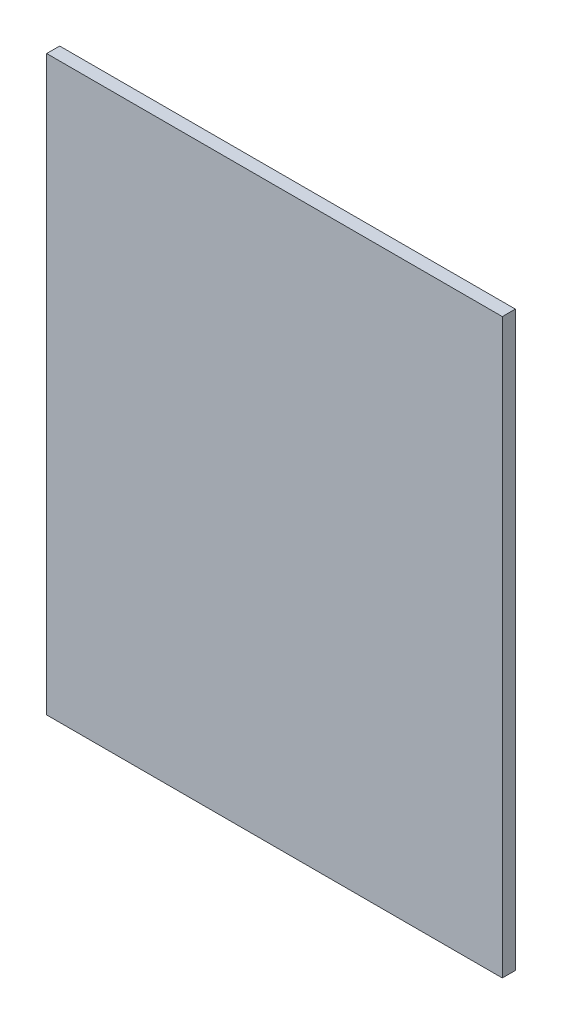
ISO-10303-21;
HEADER;
FILE_DESCRIPTION(('STEP AP214'),'2;1');
FILE_NAME('part.step','',(''),(''),'','','');
FILE_SCHEMA(('AUTOMOTIVE_DESIGN { 1 0 10303 214 1 1 1 1 }'));
ENDSEC;
DATA;
#1=APPLICATION_CONTEXT('core data for automotive mechanical design processes');
#2=APPLICATION_PROTOCOL_DEFINITION('international standard','automotive_design',2000,#1);
#3=PRODUCT_CONTEXT('',#1,'mechanical');
#4=PRODUCT('Part','Part','',(#3));
#5=PRODUCT_RELATED_PRODUCT_CATEGORY('part','',(#4));
#6=PRODUCT_DEFINITION_FORMATION('','',#4);
#7=PRODUCT_DEFINITION_CONTEXT('part definition',#1,'design');
#8=PRODUCT_DEFINITION('design','',#6,#7);
#9=PRODUCT_DEFINITION_SHAPE('','',#8);
#10=(LENGTH_UNIT() NAMED_UNIT(*) SI_UNIT(.MILLI.,.METRE.));
#11=(NAMED_UNIT(*) PLANE_ANGLE_UNIT() SI_UNIT($,.RADIAN.));
#12=(NAMED_UNIT(*) SI_UNIT($,.STERADIAN.) SOLID_ANGLE_UNIT());
#13=UNCERTAINTY_MEASURE_WITH_UNIT(LENGTH_MEASURE(1.E-05),#10,'distance_accuracy_value','');
#14=(GEOMETRIC_REPRESENTATION_CONTEXT(3) GLOBAL_UNCERTAINTY_ASSIGNED_CONTEXT((#13)) GLOBAL_UNIT_ASSIGNED_CONTEXT((#10,
#11,#12)) REPRESENTATION_CONTEXT('',''));
#15=CARTESIAN_POINT('',(0.,0.,0.));
#16=DIRECTION('',(0.,0.,1.));
#17=DIRECTION('',(1.,0.,0.));
#18=AXIS2_PLACEMENT_3D('',#15,#16,#17);
#19=CARTESIAN_POINT('',(175.,220.,5.));
#20=DIRECTION('',(-1.,0.,0.));
#21=DIRECTION('',(0.,-1.,0.));
#22=AXIS2_PLACEMENT_3D('',#19,#20,#21);
#23=PLANE('',#22);
#24=DIRECTION('',(0.,1.,0.));
#25=VECTOR('',#24,1.);
#26=CARTESIAN_POINT('',(175.,220.,-5.));
#27=LINE('',#26,#25);
#28=CARTESIAN_POINT('',(175.,-220.,-5.));
#29=VERTEX_POINT('',#28);
#30=CARTESIAN_POINT('',(175.,220.,-5.));
#31=VERTEX_POINT('',#30);
#32=EDGE_CURVE('E96',#29,#31,#27,.T.);
#33=ORIENTED_EDGE('',*,*,#32,.T.);
#34=DIRECTION('',(0.,0.,-1.));
#35=VECTOR('',#34,1.);
#36=CARTESIAN_POINT('',(175.,220.,5.));
#37=LINE('',#36,#35);
#38=CARTESIAN_POINT('',(175.,220.,5.));
#39=VERTEX_POINT('',#38);
#40=EDGE_CURVE('E11',#39,#31,#37,.T.);
#41=ORIENTED_EDGE('',*,*,#40,.F.);
#42=DIRECTION('',(0.,1.,0.));
#43=VECTOR('',#42,1.);
#44=CARTESIAN_POINT('',(175.,220.,5.));
#45=LINE('',#44,#43);
#46=CARTESIAN_POINT('',(175.,-220.,5.));
#47=VERTEX_POINT('',#46);
#48=EDGE_CURVE('E84',#47,#39,#45,.T.);
#49=ORIENTED_EDGE('',*,*,#48,.F.);
#50=DIRECTION('',(0.,0.,-1.));
#51=VECTOR('',#50,1.);
#52=CARTESIAN_POINT('',(175.,-220.,5.));
#53=LINE('',#52,#51);
#54=EDGE_CURVE('E92',#47,#29,#53,.T.);
#55=ORIENTED_EDGE('',*,*,#54,.T.);
#56=EDGE_LOOP('',(#33,#41,#49,#55));
#57=FACE_BOUND('',#56,.T.);
#58=ADVANCED_FACE('F33',(#57),#23,.F.);
#59=CARTESIAN_POINT('',(-175.,220.,5.));
#60=DIRECTION('',(0.,-1.,0.));
#61=DIRECTION('',(0.,0.,-1.));
#62=AXIS2_PLACEMENT_3D('',#59,#60,#61);
#63=PLANE('',#62);
#64=DIRECTION('',(-1.,0.,0.));
#65=VECTOR('',#64,1.);
#66=CARTESIAN_POINT('',(-175.,220.,-5.));
#67=LINE('',#66,#65);
#68=CARTESIAN_POINT('',(-175.,220.,-5.));
#69=VERTEX_POINT('',#68);
#70=EDGE_CURVE('E88',#31,#69,#67,.T.);
#71=ORIENTED_EDGE('',*,*,#70,.T.);
#72=DIRECTION('',(0.,0.,-1.));
#73=VECTOR('',#72,1.);
#74=CARTESIAN_POINT('',(-175.,220.,5.));
#75=LINE('',#74,#73);
#76=CARTESIAN_POINT('',(-175.,220.,5.));
#77=VERTEX_POINT('',#76);
#78=EDGE_CURVE('E41',#77,#69,#75,.T.);
#79=ORIENTED_EDGE('',*,*,#78,.F.);
#80=DIRECTION('',(-1.,0.,0.));
#81=VECTOR('',#80,1.);
#82=CARTESIAN_POINT('',(-175.,220.,5.));
#83=LINE('',#82,#81);
#84=EDGE_CURVE('E79',#39,#77,#83,.T.);
#85=ORIENTED_EDGE('',*,*,#84,.F.);
#86=ORIENTED_EDGE('',*,*,#40,.T.);
#87=EDGE_LOOP('',(#71,#79,#85,#86));
#88=FACE_BOUND('',#87,.T.);
#89=ADVANCED_FACE('F87',(#88),#63,.F.);
#90=CARTESIAN_POINT('',(-175.,220.,5.));
#91=DIRECTION('',(1.,0.,0.));
#92=DIRECTION('',(0.,1.,0.));
#93=AXIS2_PLACEMENT_3D('',#90,#91,#92);
#94=PLANE('',#93);
#95=DIRECTION('',(0.,-1.,0.));
#96=VECTOR('',#95,1.);
#97=CARTESIAN_POINT('',(-175.,220.,-5.));
#98=LINE('',#97,#96);
#99=CARTESIAN_POINT('',(-175.,-220.,-5.));
#100=VERTEX_POINT('',#99);
#101=EDGE_CURVE('E66',#69,#100,#98,.T.);
#102=ORIENTED_EDGE('',*,*,#101,.T.);
#103=DIRECTION('',(0.,0.,-1.));
#104=VECTOR('',#103,1.);
#105=CARTESIAN_POINT('',(-175.,-220.,5.));
#106=LINE('',#105,#104);
#107=CARTESIAN_POINT('',(-175.,-220.,5.));
#108=VERTEX_POINT('',#107);
#109=EDGE_CURVE('E89',#108,#100,#106,.T.);
#110=ORIENTED_EDGE('',*,*,#109,.F.);
#111=DIRECTION('',(0.,-1.,0.));
#112=VECTOR('',#111,1.);
#113=CARTESIAN_POINT('',(-175.,220.,5.));
#114=LINE('',#113,#112);
#115=EDGE_CURVE('E82',#77,#108,#114,.T.);
#116=ORIENTED_EDGE('',*,*,#115,.F.);
#117=ORIENTED_EDGE('',*,*,#78,.T.);
#118=EDGE_LOOP('',(#102,#110,#116,#117));
#119=FACE_BOUND('',#118,.T.);
#120=ADVANCED_FACE('F90',(#119),#94,.F.);
#121=CARTESIAN_POINT('',(-175.,-220.,5.));
#122=DIRECTION('',(0.,1.,0.));
#123=DIRECTION('',(0.,0.,1.));
#124=AXIS2_PLACEMENT_3D('',#121,#122,#123);
#125=PLANE('',#124);
#126=DIRECTION('',(1.,0.,0.));
#127=VECTOR('',#126,1.);
#128=CARTESIAN_POINT('',(-175.,-220.,-5.));
#129=LINE('',#128,#127);
#130=EDGE_CURVE('E72',#100,#29,#129,.T.);
#131=ORIENTED_EDGE('',*,*,#130,.T.);
#132=ORIENTED_EDGE('',*,*,#54,.F.);
#133=DIRECTION('',(1.,0.,0.));
#134=VECTOR('',#133,1.);
#135=CARTESIAN_POINT('',(-175.,-220.,5.));
#136=LINE('',#135,#134);
#137=EDGE_CURVE('E49',#108,#47,#136,.T.);
#138=ORIENTED_EDGE('',*,*,#137,.F.);
#139=ORIENTED_EDGE('',*,*,#109,.T.);
#140=EDGE_LOOP('',(#131,#132,#138,#139));
#141=FACE_BOUND('',#140,.T.);
#142=ADVANCED_FACE('F103',(#141),#125,.F.);
#143=CARTESIAN_POINT('',(0.,0.,5.));
#144=DIRECTION('',(0.,0.,1.));
#145=DIRECTION('',(1.,0.,0.));
#146=AXIS2_PLACEMENT_3D('',#143,#144,#145);
#147=PLANE('',#146);
#148=ORIENTED_EDGE('',*,*,#48,.T.);
#149=ORIENTED_EDGE('',*,*,#84,.T.);
#150=ORIENTED_EDGE('',*,*,#115,.T.);
#151=ORIENTED_EDGE('',*,*,#137,.T.);
#152=EDGE_LOOP('',(#148,#149,#150,#151));
#153=FACE_BOUND('',#152,.T.);
#154=ADVANCED_FACE('F80',(#153),#147,.T.);
#155=CARTESIAN_POINT('',(0.,0.,-5.));
#156=DIRECTION('',(0.,0.,1.));
#157=DIRECTION('',(1.,0.,0.));
#158=AXIS2_PLACEMENT_3D('',#155,#156,#157);
#159=PLANE('',#158);
#160=ORIENTED_EDGE('',*,*,#32,.F.);
#161=ORIENTED_EDGE('',*,*,#130,.F.);
#162=ORIENTED_EDGE('',*,*,#101,.F.);
#163=ORIENTED_EDGE('',*,*,#70,.F.);
#164=EDGE_LOOP('',(#160,#161,#162,#163));
#165=FACE_BOUND('',#164,.T.);
#166=ADVANCED_FACE('F106',(#165),#159,.F.);
#167=CLOSED_SHELL('',(#58,#89,#120,#142,#154,#166));
#168=MANIFOLD_SOLID_BREP('B2',#167);
#169=ADVANCED_BREP_SHAPE_REPRESENTATION('',(#18,#168),#14);
#170=SHAPE_DEFINITION_REPRESENTATION(#9,#169);
ENDSEC;
END-ISO-10303-21;
